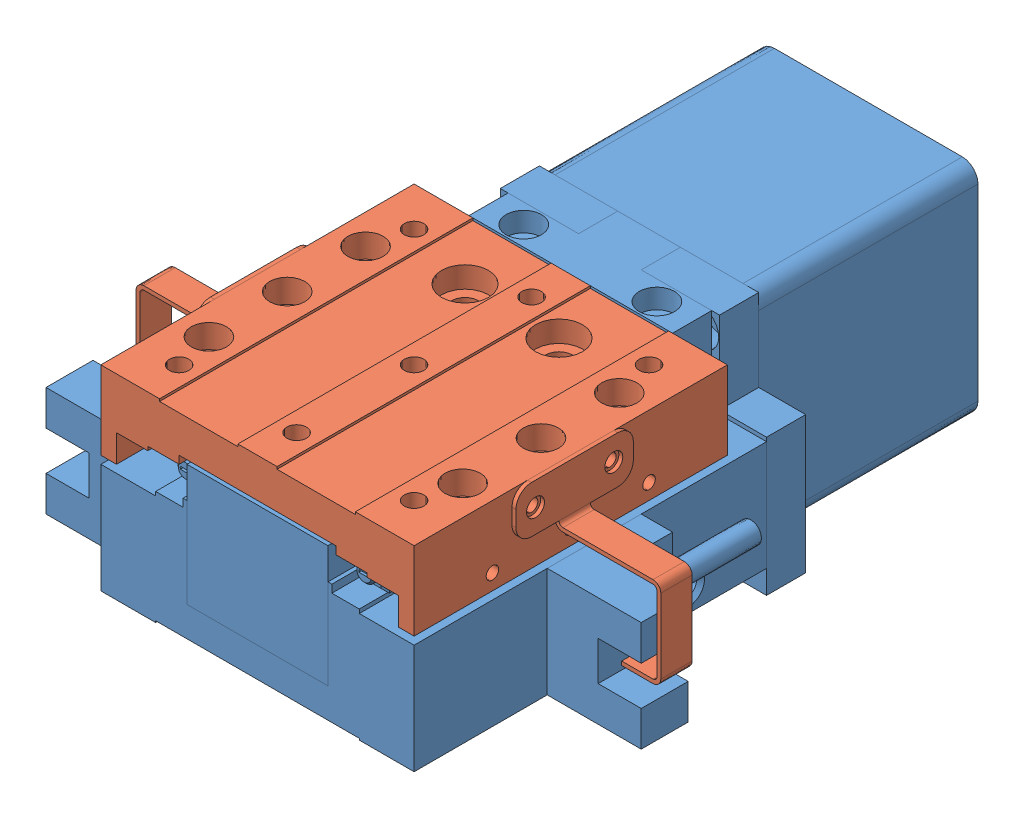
SolidWorks assembly TCD04010.SLDASM, configuration 默认 (file format 9000). Lengths in mm.
Overall size (67 28 78).
2 component instances, 2 part files, 3 mates.
Components (placement in the parent):
- TCD-04010-01-1: TCD-04010-01.SLDPRT [默认] at (35.564 -27.4837 71.1677) size (64 28 78)
- TCD-04010-02-1: TCD-04010-02.SLDPRT [默认] at (35.564 -27.4837 71.1677) size (67 18 40)
Mates (geometry in assembly coordinates):
- 宽度1: width aligned: plane of TCD-04010-01-1 through (24.1488 -8.455 135) normal (1 0 0); plane of TCD-04010-01-1 through (-15.8512 6.045 135) normal (-1 0 0); plane of TCD-04010-02-1 through (24.1488 6.545 135) normal (1 0 0); plane of TCD-04010-02-1 through (-15.8512 16.545 135) normal (-1 0 0)
- 重合1: coincident aligned: plane of TCD-04010-02-1 through (24.1488 16.545 135) normal (0 1 0); plane of TCD-04010-01-1 through (4.1488 16.545 95) normal (0 1 0)
- LimitDistance1: limit distance anti-aligned: plane of TCD-04010-02-1 through (4.1488 16.545 95) normal (0 0 -1); plane of TCD-04010-01-1 through (17.1488 16.545 95) normal (0 0 1)
